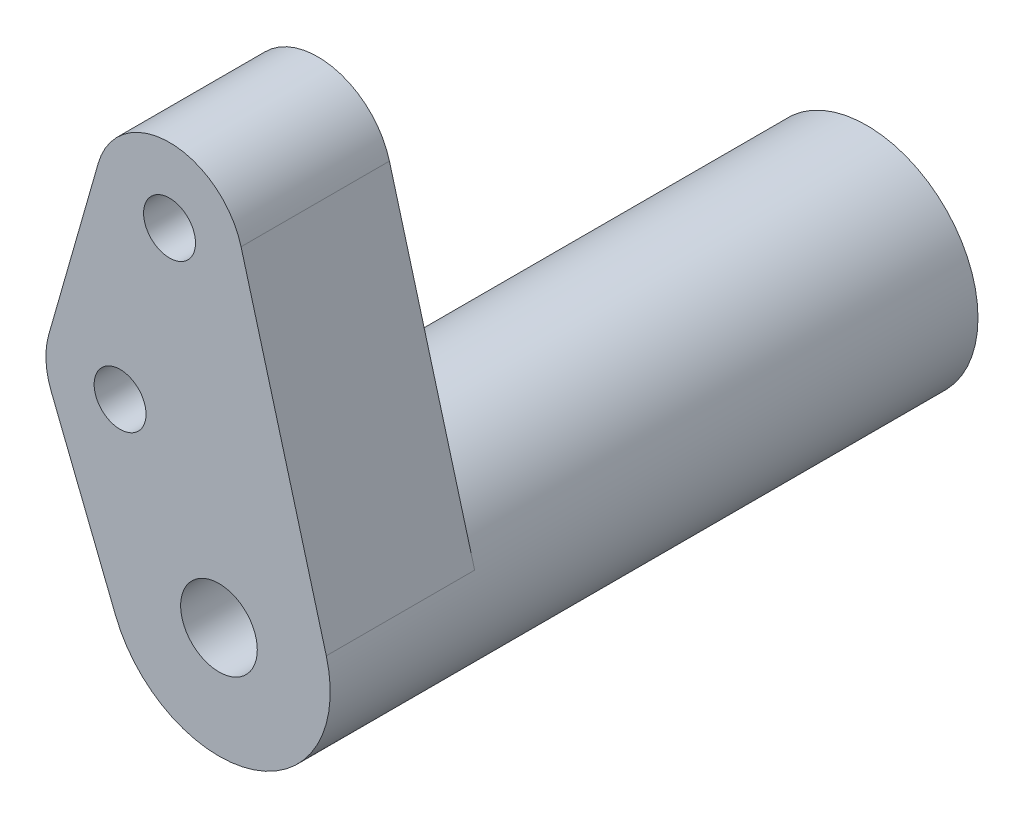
from build123d import *

# Parameters (mm, degrees)
SK_COLUMNA_R           = 9
SK_COLUMNA_R_2         = 3.1
COLUMNA_DEPTH          = 40.4
SK_CUERPO_INFERIOR_R   = 2.1
SK_CUERPO_INFERIOR_R_2 = 3.1
CUERPO_INFERIOR_DEPTH  = 12


with BuildPart() as part:
    # Sk_Columna → Columna (new body)
    with BuildSketch(Plane.XY.offset(14)):
        with Locations((-36, -62)):
            Circle(SK_COLUMNA_R)
        with Locations((-36, -62)):
            Circle(SK_COLUMNA_R_2, mode=Mode.SUBTRACT)
    extrude(amount=COLUMNA_DEPTH)

    # Sk_Cuerpo_inferior → Cuerpo_inferior (add)
    with BuildSketch(Plane.XY.offset(54.4)):
        with BuildLine():
            Line((-49.575408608, -52.216939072), (-44.363112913, -65.325408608))
            ThreePointArc((-44.363112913, -65.325408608), (-33.145841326, -70.535442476), (-27.318758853, -59.6259629))
            Line((-27.318758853, -59.6259629), (-34.212505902, -34.4173086))
            ThreePointArc((-34.212505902, -34.4173086), (-39.965923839, -30.000096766), (-45.769143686, -34.351673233))
            Line((-45.769143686, -34.351673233), (-49.769143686, -48.351673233))
            ThreePointArc((-49.769143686, -48.351673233), (-49.992477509, -50.300355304), (-49.575408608, -52.216939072))
        make_face()
        with Locations((-40, -36)):
            Circle(SK_CUERPO_INFERIOR_R, mode=Mode.SUBTRACT)
        with Locations((-44, -50)):
            Circle(SK_CUERPO_INFERIOR_R, mode=Mode.SUBTRACT)
        with Locations((-36, -62)):
            Circle(SK_CUERPO_INFERIOR_R_2, mode=Mode.SUBTRACT)
    extrude(amount=CUERPO_INFERIOR_DEPTH)


solid = part.part
